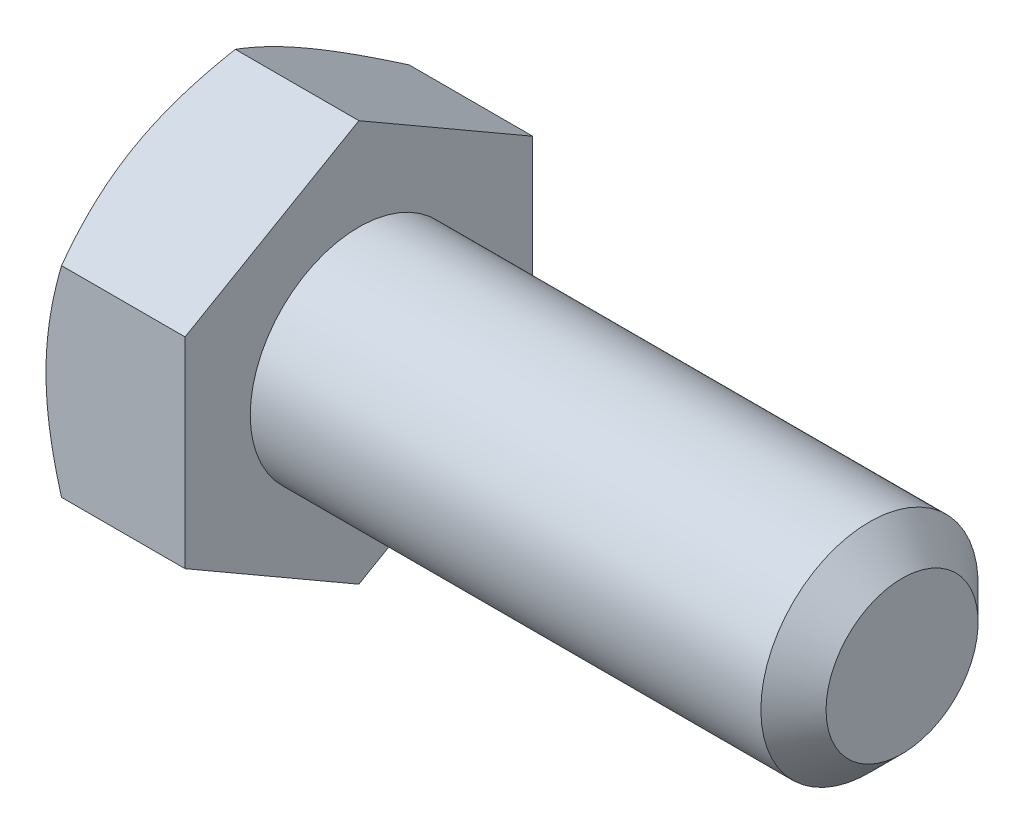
ISO-10303-21;
HEADER;
FILE_DESCRIPTION(('STEP AP214'),'2;1');
FILE_NAME('part.step','',(''),(''),'','','');
FILE_SCHEMA(('AUTOMOTIVE_DESIGN { 1 0 10303 214 1 1 1 1 }'));
ENDSEC;
DATA;
#1=APPLICATION_CONTEXT('core data for automotive mechanical design processes');
#2=APPLICATION_PROTOCOL_DEFINITION('international standard','automotive_design',2000,#1);
#3=PRODUCT_CONTEXT('',#1,'mechanical');
#4=PRODUCT('Part','Part','',(#3));
#5=PRODUCT_RELATED_PRODUCT_CATEGORY('part','',(#4));
#6=PRODUCT_DEFINITION_FORMATION('','',#4);
#7=PRODUCT_DEFINITION_CONTEXT('part definition',#1,'design');
#8=PRODUCT_DEFINITION('design','',#6,#7);
#9=PRODUCT_DEFINITION_SHAPE('','',#8);
#10=(LENGTH_UNIT() NAMED_UNIT(*) SI_UNIT(.MILLI.,.METRE.));
#11=(NAMED_UNIT(*) PLANE_ANGLE_UNIT() SI_UNIT($,.RADIAN.));
#12=(NAMED_UNIT(*) SI_UNIT($,.STERADIAN.) SOLID_ANGLE_UNIT());
#13=UNCERTAINTY_MEASURE_WITH_UNIT(LENGTH_MEASURE(1.E-05),#10,'distance_accuracy_value','');
#14=(GEOMETRIC_REPRESENTATION_CONTEXT(3) GLOBAL_UNCERTAINTY_ASSIGNED_CONTEXT((#13)) GLOBAL_UNIT_ASSIGNED_CONTEXT((#10,
#11,#12)) REPRESENTATION_CONTEXT('',''));
#15=CARTESIAN_POINT('',(0.,0.,0.));
#16=DIRECTION('',(0.,0.,1.));
#17=DIRECTION('',(1.,0.,0.));
#18=AXIS2_PLACEMENT_3D('',#15,#16,#17);
#19=CARTESIAN_POINT('',(25.,0.,0.));
#20=DIRECTION('',(-1.,0.,0.));
#21=DIRECTION('',(0.,0.,1.));
#22=AXIS2_PLACEMENT_3D('',#19,#20,#21);
#23=CYLINDRICAL_SURFACE('',#22,5.);
#24=CARTESIAN_POINT('',(23.5,0.,0.));
#25=DIRECTION('',(1.,0.,0.));
#26=DIRECTION('',(0.,0.,-1.));
#27=AXIS2_PLACEMENT_3D('',#24,#25,#26);
#28=CIRCLE('',#27,5.);
#29=CARTESIAN_POINT('',(23.5,0.,5.));
#30=VERTEX_POINT('',#29);
#31=EDGE_CURVE('E11',#30,#30,#28,.F.);
#32=ORIENTED_EDGE('',*,*,#31,.T.);
#33=EDGE_LOOP('',(#32));
#34=FACE_BOUND('',#33,.T.);
#35=CARTESIAN_POINT('',(0.,0.,0.));
#36=DIRECTION('',(-1.,0.,0.));
#37=DIRECTION('',(0.,0.,1.));
#38=AXIS2_PLACEMENT_3D('',#35,#36,#37);
#39=CIRCLE('',#38,5.);
#40=CARTESIAN_POINT('',(0.,0.,5.));
#41=VERTEX_POINT('',#40);
#42=EDGE_CURVE('E537',#41,#41,#39,.T.);
#43=ORIENTED_EDGE('',*,*,#42,.F.);
#44=EDGE_LOOP('',(#43));
#45=FACE_BOUND('',#44,.T.);
#46=ADVANCED_FACE('F362',(#34,#45),#23,.T.);
#47=CARTESIAN_POINT('',(25.,0.,0.));
#48=DIRECTION('',(1.,0.,0.));
#49=DIRECTION('',(0.,0.,-1.));
#50=AXIS2_PLACEMENT_3D('',#47,#48,#49);
#51=PLANE('',#50);
#52=CARTESIAN_POINT('',(25.,0.,0.));
#53=DIRECTION('',(1.,0.,0.));
#54=DIRECTION('',(0.,0.,-1.));
#55=AXIS2_PLACEMENT_3D('',#52,#53,#54);
#56=CIRCLE('',#55,3.49999999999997);
#57=CARTESIAN_POINT('',(25.,0.,3.49999999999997));
#58=VERTEX_POINT('',#57);
#59=EDGE_CURVE('E369',#58,#58,#56,.T.);
#60=ORIENTED_EDGE('',*,*,#59,.T.);
#61=EDGE_LOOP('',(#60));
#62=FACE_BOUND('',#61,.T.);
#63=ADVANCED_FACE('F522',(#62),#51,.T.);
#64=CARTESIAN_POINT('',(0.,-4.61880215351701,8.));
#65=DIRECTION('',(-1.,0.,0.));
#66=DIRECTION('',(0.,0.,1.));
#67=AXIS2_PLACEMENT_3D('',#64,#65,#66);
#68=PLANE('',#67);
#69=DIRECTION('',(0.,0.5,0.866025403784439));
#70=VECTOR('',#69,1.);
#71=CARTESIAN_POINT('',(0.,-9.23760430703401,0.));
#72=LINE('',#71,#70);
#73=CARTESIAN_POINT('',(0.,-9.23760430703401,0.));
#74=VERTEX_POINT('',#73);
#75=CARTESIAN_POINT('',(0.,-4.61880215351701,8.));
#76=VERTEX_POINT('',#75);
#77=EDGE_CURVE('E564',#74,#76,#72,.T.);
#78=ORIENTED_EDGE('',*,*,#77,.F.);
#79=DIRECTION('',(0.,0.5,-0.866025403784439));
#80=VECTOR('',#79,1.);
#81=CARTESIAN_POINT('',(0.,-9.23760430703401,0.));
#82=LINE('',#81,#80);
#83=CARTESIAN_POINT('',(0.,-4.61880215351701,-8.));
#84=VERTEX_POINT('',#83);
#85=EDGE_CURVE('E551',#74,#84,#82,.T.);
#86=ORIENTED_EDGE('',*,*,#85,.T.);
#87=DIRECTION('',(0.,1.,0.));
#88=VECTOR('',#87,1.);
#89=CARTESIAN_POINT('',(0.,-4.61880215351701,-8.));
#90=LINE('',#89,#88);
#91=CARTESIAN_POINT('',(0.,4.618802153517,-8.));
#92=VERTEX_POINT('',#91);
#93=EDGE_CURVE('E554',#84,#92,#90,.T.);
#94=ORIENTED_EDGE('',*,*,#93,.T.);
#95=DIRECTION('',(0.,0.5,0.866025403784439));
#96=VECTOR('',#95,1.);
#97=CARTESIAN_POINT('',(0.,4.618802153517,-8.));
#98=LINE('',#97,#96);
#99=CARTESIAN_POINT('',(0.,9.23760430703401,0.));
#100=VERTEX_POINT('',#99);
#101=EDGE_CURVE('E557',#92,#100,#98,.T.);
#102=ORIENTED_EDGE('',*,*,#101,.T.);
#103=DIRECTION('',(0.,0.5,-0.866025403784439));
#104=VECTOR('',#103,1.);
#105=CARTESIAN_POINT('',(0.,4.618802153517,8.));
#106=LINE('',#105,#104);
#107=CARTESIAN_POINT('',(0.,4.618802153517,8.));
#108=VERTEX_POINT('',#107);
#109=EDGE_CURVE('E560',#108,#100,#106,.T.);
#110=ORIENTED_EDGE('',*,*,#109,.F.);
#111=DIRECTION('',(0.,1.,0.));
#112=VECTOR('',#111,1.);
#113=CARTESIAN_POINT('',(0.,-4.61880215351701,8.));
#114=LINE('',#113,#112);
#115=EDGE_CURVE('E562',#76,#108,#114,.T.);
#116=ORIENTED_EDGE('',*,*,#115,.F.);
#117=EDGE_LOOP('',(#78,#86,#94,#102,#110,#116));
#118=FACE_BOUND('',#117,.T.);
#119=ORIENTED_EDGE('',*,*,#42,.T.);
#120=EDGE_LOOP('',(#119));
#121=FACE_BOUND('',#120,.T.);
#122=ADVANCED_FACE('F493',(#118,#121),#68,.F.);
#123=CARTESIAN_POINT('',(-6.4,-9.23760430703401,0.));
#124=DIRECTION('',(0.,0.866025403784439,-0.5));
#125=DIRECTION('',(0.,0.5,0.866025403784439));
#126=AXIS2_PLACEMENT_3D('',#123,#124,#125);
#127=PLANE('',#126);
#128=CARTESIAN_POINT('',(-5.68540215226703,-9.23771977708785,-0.00020000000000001));
#129=CARTESIAN_POINT('',(-5.7440092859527,-9.13619343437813,0.175648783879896));
#130=CARTESIAN_POINT('',(-5.79995659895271,-9.03428856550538,0.352153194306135));
#131=CARTESIAN_POINT('',(-5.90579899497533,-8.82965122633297,0.70659546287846));
#132=CARTESIAN_POINT('',(-5.95569146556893,-8.72691841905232,0.884533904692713));
#133=CARTESIAN_POINT('',(-6.09530720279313,-8.41707512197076,1.42119823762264));
#134=CARTESIAN_POINT('',(-6.17471882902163,-8.20874154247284,1.78204258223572));
#135=CARTESIAN_POINT('',(-6.26783835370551,-7.89697436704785,2.32203917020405));
#136=CARTESIAN_POINT('',(-6.29436541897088,-7.79447216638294,2.49957818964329));
#137=CARTESIAN_POINT('',(-6.33884682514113,-7.58900421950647,2.8554591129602));
#138=CARTESIAN_POINT('',(-6.35680192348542,-7.4860385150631,3.03380094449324));
#139=CARTESIAN_POINT('',(-6.38368435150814,-7.27992981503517,3.3907916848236));
#140=CARTESIAN_POINT('',(-6.39262192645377,-7.17678715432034,3.5694400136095));
#141=CARTESIAN_POINT('',(-6.40127769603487,-6.97040655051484,3.92690170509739));
#142=CARTESIAN_POINT('',(-6.40099617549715,-6.86716861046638,4.10571506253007));
#143=CARTESIAN_POINT('',(-6.39185497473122,-6.67416139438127,4.44001336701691));
#144=CARTESIAN_POINT('',(-6.38411039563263,-6.58437849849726,4.59552190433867));
#145=CARTESIAN_POINT('',(-6.36179886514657,-6.40502298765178,4.90617476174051));
#146=CARTESIAN_POINT('',(-6.34723145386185,-6.31545038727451,5.06131905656));
#147=CARTESIAN_POINT('',(-6.29363930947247,-6.04707935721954,5.52615131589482));
#148=CARTESIAN_POINT('',(-6.24473135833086,-5.86875596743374,5.83501648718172));
#149=CARTESIAN_POINT('',(-6.12246059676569,-5.51021755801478,6.4560232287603));
#150=CARTESIAN_POINT('',(-6.048579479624,-5.33004829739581,6.76808554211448));
#151=CARTESIAN_POINT('',(-5.88089985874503,-4.97239658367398,7.38755648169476));
#152=CARTESIAN_POINT('',(-5.78714073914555,-4.79490955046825,7.69497304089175));
#153=CARTESIAN_POINT('',(-5.68540215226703,-4.61868668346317,8.0002));
#154=B_SPLINE_CURVE_WITH_KNOTS('',3,(#128,#129,#130,#131,#132,#133,#134,#135,#136,#137,#138,
#139,#140,#141,#142,#143,#144,#145,#146,#147,#148,#149,#150,#151,#152,#153),.UNSPECIFIED.,.F.,
.F.,(4,2,2,2,2,2,2,2,2,2,2,2,4),(0.,0.63397354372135,1.26821965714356,2.53934712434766,
3.15934343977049,3.77928496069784,4.39852133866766,5.01773858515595,5.55680239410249,
6.09590254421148,7.17487077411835,8.27776850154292,9.37850115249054),.UNSPECIFIED.);
#155=CARTESIAN_POINT('',(-5.68546882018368,-9.23760430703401,0.));
#156=VERTEX_POINT('',#155);
#157=CARTESIAN_POINT('',(-6.4,-6.92820323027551,4.));
#158=VERTEX_POINT('',#157);
#159=EDGE_CURVE('E510',#156,#158,#154,.T.);
#160=ORIENTED_EDGE('',*,*,#159,.F.);
#161=DIRECTION('',(1.,0.,0.));
#162=VECTOR('',#161,1.);
#163=CARTESIAN_POINT('',(-6.4,-9.23760430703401,0.));
#164=LINE('',#163,#162);
#165=EDGE_CURVE('E549',#156,#74,#164,.T.);
#166=ORIENTED_EDGE('',*,*,#165,.T.);
#167=ORIENTED_EDGE('',*,*,#77,.T.);
#168=DIRECTION('',(1.,0.,0.));
#169=VECTOR('',#168,1.);
#170=CARTESIAN_POINT('',(-6.4,-4.61880215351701,8.));
#171=LINE('',#170,#169);
#172=CARTESIAN_POINT('',(-5.68546882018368,-4.61880215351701,8.));
#173=VERTEX_POINT('',#172);
#174=EDGE_CURVE('E540',#173,#76,#171,.T.);
#175=ORIENTED_EDGE('',*,*,#174,.F.);
#176=EDGE_CURVE('E464',#158,#173,#154,.T.);
#177=ORIENTED_EDGE('',*,*,#176,.F.);
#178=EDGE_LOOP('',(#160,#166,#167,#175,#177));
#179=FACE_BOUND('',#178,.T.);
#180=ADVANCED_FACE('F516',(#179),#127,.F.);
#181=CARTESIAN_POINT('',(-6.4,-4.61880215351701,8.));
#182=DIRECTION('',(0.,0.,-1.));
#183=DIRECTION('',(-1.,0.,0.));
#184=AXIS2_PLACEMENT_3D('',#181,#182,#183);
#185=PLANE('',#184);
#186=CARTESIAN_POINT('',(-2.40281206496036,-12.5978512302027,8.));
#187=CARTESIAN_POINT('',(-2.57388946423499,-12.246746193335,8.));
#188=CARTESIAN_POINT('',(-2.74338074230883,-11.8948553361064,8.));
#189=CARTESIAN_POINT('',(-3.07830251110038,-11.1890846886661,8.));
#190=CARTESIAN_POINT('',(-3.24373239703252,-10.8352046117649,8.));
#191=CARTESIAN_POINT('',(-3.57043443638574,-10.1233054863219,8.));
#192=CARTESIAN_POINT('',(-3.73168065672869,-9.76527449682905,8.));
#193=CARTESIAN_POINT('',(-4.04782365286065,-9.04643054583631,8.));
#194=CARTESIAN_POINT('',(-4.20272071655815,-8.68561771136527,8.));
#195=CARTESIAN_POINT('',(-4.50960168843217,-7.94836823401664,8.));
#196=CARTESIAN_POINT('',(-4.66130959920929,-7.57181608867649,8.));
#197=CARTESIAN_POINT('',(-4.95369969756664,-6.81437869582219,8.));
#198=CARTESIAN_POINT('',(-5.09438067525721,-6.4334929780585,8.));
#199=CARTESIAN_POINT('',(-5.36116349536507,-5.66743059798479,8.));
#200=CARTESIAN_POINT('',(-5.48729325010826,-5.28226375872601,8.));
#201=CARTESIAN_POINT('',(-5.72105487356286,-4.50642197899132,8.));
#202=CARTESIAN_POINT('',(-5.82869236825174,-4.11574875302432,8.));
#203=CARTESIAN_POINT('',(-6.01985550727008,-3.3307685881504,8.));
#204=CARTESIAN_POINT('',(-6.10351603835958,-2.93649538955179,8.));
#205=CARTESIAN_POINT('',(-6.20749259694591,-2.34134760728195,8.));
#206=CARTESIAN_POINT('',(-6.23856705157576,-2.14232908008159,8.));
#207=CARTESIAN_POINT('',(-6.29294025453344,-1.74323916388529,8.));
#208=CARTESIAN_POINT('',(-6.31623975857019,-1.54316787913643,8.));
#209=CARTESIAN_POINT('',(-6.35429623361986,-1.14493807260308,8.));
#210=CARTESIAN_POINT('',(-6.36916434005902,-0.946790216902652,8.));
#211=CARTESIAN_POINT('',(-6.39050002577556,-0.55004265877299,8.));
#212=CARTESIAN_POINT('',(-6.39696775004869,-0.351442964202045,8.));
#213=CARTESIAN_POINT('',(-6.40134753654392,0.0458536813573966,8.));
#214=CARTESIAN_POINT('',(-6.39925955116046,0.244550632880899,8.));
#215=CARTESIAN_POINT('',(-6.38658102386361,0.641675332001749,8.));
#216=CARTESIAN_POINT('',(-6.37599009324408,0.840103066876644,8.));
#217=CARTESIAN_POINT('',(-6.34097810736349,1.31123186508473,8.));
#218=CARTESIAN_POINT('',(-6.31284309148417,1.58366327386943,8.));
#219=CARTESIAN_POINT('',(-6.24203710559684,2.12661564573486,8.));
#220=CARTESIAN_POINT('',(-6.19936432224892,2.39713636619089,8.));
#221=CARTESIAN_POINT('',(-6.05179305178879,3.20545284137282,8.));
#222=CARTESIAN_POINT('',(-5.92736416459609,3.73973646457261,8.));
#223=CARTESIAN_POINT('',(-5.71012995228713,4.53906436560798,8.));
#224=CARTESIAN_POINT('',(-5.63154182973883,4.80821183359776,8.));
#225=CARTESIAN_POINT('',(-5.46584170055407,5.3438959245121,8.));
#226=CARTESIAN_POINT('',(-5.37872962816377,5.61043252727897,8.));
#227=CARTESIAN_POINT('',(-5.19740915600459,6.14097486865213,8.));
#228=CARTESIAN_POINT('',(-5.10320275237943,6.40498129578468,8.));
#229=CARTESIAN_POINT('',(-4.90883812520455,6.93077992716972,8.));
#230=CARTESIAN_POINT('',(-4.80868003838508,7.19257218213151,8.));
#231=CARTESIAN_POINT('',(-4.53123135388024,7.89757234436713,8.));
#232=CARTESIAN_POINT('',(-4.34922056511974,8.338920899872,8.));
#233=CARTESIAN_POINT('',(-3.97449001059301,9.21706508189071,8.));
#234=CARTESIAN_POINT('',(-3.78176905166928,9.65386019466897,8.));
#235=CARTESIAN_POINT('',(-3.38815487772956,10.5239434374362,8.));
#236=CARTESIAN_POINT('',(-3.18725853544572,10.9572301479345,8.));
#237=CARTESIAN_POINT('',(-2.77925077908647,11.8208356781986,8.));
#238=CARTESIAN_POINT('',(-2.57213961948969,12.2511546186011,8.));
#239=CARTESIAN_POINT('',(-2.15271844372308,13.1101061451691,8.));
#240=CARTESIAN_POINT('',(-1.94040058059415,13.5387348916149,8.));
#241=CARTESIAN_POINT('',(-1.51189757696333,14.3940561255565,8.));
#242=CARTESIAN_POINT('',(-1.29571240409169,14.8207485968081,8.));
#243=CARTESIAN_POINT('',(-0.860283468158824,15.6724483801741,8.));
#244=CARTESIAN_POINT('',(-0.641040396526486,16.0974560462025,8.));
#245=CARTESIAN_POINT('',(-0.20002108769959,16.9461557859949,8.));
#246=CARTESIAN_POINT('',(0.0217551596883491,17.3698478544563,8.));
#247=CARTESIAN_POINT('',(0.642968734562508,18.5495919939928,8.));
#248=CARTESIAN_POINT('',(1.04468640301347,19.3044430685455,8.));
#249=CARTESIAN_POINT('',(1.8529450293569,20.8116128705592,8.));
#250=CARTESIAN_POINT('',(2.25948628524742,21.5639314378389,8.));
#251=CARTESIAN_POINT('',(3.07479055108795,23.064082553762,8.));
#252=CARTESIAN_POINT('',(3.48354147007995,23.8119216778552,8.));
#253=CARTESIAN_POINT('',(4.09870759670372,24.9325210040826,8.));
#254=CARTESIAN_POINT('',(4.30409483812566,25.3058462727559,8.));
#255=CARTESIAN_POINT('',(4.71547851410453,26.0521604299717,8.));
#256=CARTESIAN_POINT('',(4.92147494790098,26.4251493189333,8.));
#257=CARTESIAN_POINT('',(5.12773824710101,26.7979906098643,8.));
#258=B_SPLINE_CURVE_WITH_KNOTS('',3,(#186,#187,#188,#189,#190,#191,#192,#193,#194,#195,#196,
#197,#198,#199,#200,#201,#202,#203,#204,#205,#206,#207,#208,#209,#210,#211,#212,#213,#214,#215,
#216,#217,#218,#219,#220,#221,#222,#223,#224,#225,#226,#227,#228,#229,#230,#231,#232,#233,#234,
#235,#236,#237,#238,#239,#240,#241,#242,#243,#244,#245,#246,#247,#248,#249,#250,#251,#252,#253,
#254,#255,#256,#257),.UNSPECIFIED.,.F.,.F.,(4,2,2,2,2,2,2,2,2,2,2,2,2,2,2,2,2,2,2,2,2,2,2,2,2,2,
2,2,2,2,2,2,2,2,2,4),(0.,1.17171303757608,2.34359951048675,3.52154779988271,4.69944261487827,
5.9172006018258,7.13509201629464,8.350606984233,9.56575149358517,10.7739194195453,
11.3780811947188,11.982184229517,12.5781274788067,13.174060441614,13.7699967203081,
14.3659602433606,15.1871414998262,16.0084252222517,17.651791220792,18.4928743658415,
19.3339639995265,20.1748178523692,21.0156523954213,22.4476587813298,23.87982501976,
25.312544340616,26.7452050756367,28.1801767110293,29.6151603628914,31.0498246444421,
32.48449470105,35.0497345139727,37.6151336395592,40.1718943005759,41.4501744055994,
42.7284529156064),.UNSPECIFIED.);
#259=CARTESIAN_POINT('',(-6.4,0.,8.));
#260=VERTEX_POINT('',#259);
#261=EDGE_CURVE('E566',#173,#260,#258,.T.);
#262=ORIENTED_EDGE('',*,*,#261,.F.);
#263=ORIENTED_EDGE('',*,*,#174,.T.);
#264=ORIENTED_EDGE('',*,*,#115,.T.);
#265=DIRECTION('',(1.,0.,0.));
#266=VECTOR('',#265,1.);
#267=CARTESIAN_POINT('',(-6.4,4.618802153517,8.));
#268=LINE('',#267,#266);
#269=CARTESIAN_POINT('',(-5.68546882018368,4.618802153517,8.));
#270=VERTEX_POINT('',#269);
#271=EDGE_CURVE('E542',#270,#108,#268,.T.);
#272=ORIENTED_EDGE('',*,*,#271,.F.);
#273=EDGE_CURVE('E435',#260,#270,#258,.T.);
#274=ORIENTED_EDGE('',*,*,#273,.F.);
#275=EDGE_LOOP('',(#262,#263,#264,#272,#274));
#276=FACE_BOUND('',#275,.T.);
#277=ADVANCED_FACE('F519',(#276),#185,.F.);
#278=CARTESIAN_POINT('',(-6.4,4.618802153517,8.));
#279=DIRECTION('',(0.,-0.866025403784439,-0.5));
#280=DIRECTION('',(0.,0.5,-0.866025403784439));
#281=AXIS2_PLACEMENT_3D('',#278,#279,#280);
#282=PLANE('',#281);
#283=CARTESIAN_POINT('',(-5.68540215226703,4.61868668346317,8.0002));
#284=CARTESIAN_POINT('',(-5.7440092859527,4.72021302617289,7.8243512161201));
#285=CARTESIAN_POINT('',(-5.79995659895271,4.82211789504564,7.64784680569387));
#286=CARTESIAN_POINT('',(-5.90579899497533,5.02675523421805,7.29340453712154));
#287=CARTESIAN_POINT('',(-5.95569146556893,5.12948804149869,7.11546609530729));
#288=CARTESIAN_POINT('',(-6.09530720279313,5.43933133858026,6.57880176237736));
#289=CARTESIAN_POINT('',(-6.17471882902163,5.64766491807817,6.21795741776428));
#290=CARTESIAN_POINT('',(-6.26783835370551,5.95943209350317,5.67796082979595));
#291=CARTESIAN_POINT('',(-6.29436541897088,6.06193429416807,5.50042181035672));
#292=CARTESIAN_POINT('',(-6.33884682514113,6.26740224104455,5.1445408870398));
#293=CARTESIAN_POINT('',(-6.35680192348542,6.37036794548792,4.96619905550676));
#294=CARTESIAN_POINT('',(-6.38368435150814,6.57647664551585,4.60920831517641));
#295=CARTESIAN_POINT('',(-6.39262192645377,6.67961930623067,4.4305599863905));
#296=CARTESIAN_POINT('',(-6.40127769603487,6.88599991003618,4.07309829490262));
#297=CARTESIAN_POINT('',(-6.40099617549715,6.98923785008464,3.89428493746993));
#298=CARTESIAN_POINT('',(-6.39185497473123,7.18224506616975,3.5599866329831));
#299=CARTESIAN_POINT('',(-6.38411039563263,7.27202796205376,3.40447809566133));
#300=CARTESIAN_POINT('',(-6.36179886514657,7.45138347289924,3.09382523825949));
#301=CARTESIAN_POINT('',(-6.34723145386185,7.5409560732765,2.93868094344));
#302=CARTESIAN_POINT('',(-6.29363930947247,7.80932710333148,2.47384868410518));
#303=CARTESIAN_POINT('',(-6.24473135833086,7.98765049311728,2.16498351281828));
#304=CARTESIAN_POINT('',(-6.12246059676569,8.34618890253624,1.5439767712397));
#305=CARTESIAN_POINT('',(-6.048579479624,8.52635816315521,1.23191445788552));
#306=CARTESIAN_POINT('',(-5.88089985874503,8.88400987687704,0.612443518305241));
#307=CARTESIAN_POINT('',(-5.78714073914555,9.06149691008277,0.305026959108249));
#308=CARTESIAN_POINT('',(-5.68540215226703,9.23771977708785,-0.000200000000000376));
#309=B_SPLINE_CURVE_WITH_KNOTS('',3,(#283,#284,#285,#286,#287,#288,#289,#290,#291,#292,#293,
#294,#295,#296,#297,#298,#299,#300,#301,#302,#303,#304,#305,#306,#307,#308),.UNSPECIFIED.,.F.,
.F.,(4,2,2,2,2,2,2,2,2,2,2,2,4),(0.,0.633973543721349,1.26821965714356,2.53934712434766,
3.15934343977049,3.77928496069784,4.39852133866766,5.01773858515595,5.55680239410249,
6.09590254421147,7.17487077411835,8.27776850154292,9.37850115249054),.UNSPECIFIED.);
#310=CARTESIAN_POINT('',(-6.4,6.92820323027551,4.));
#311=VERTEX_POINT('',#310);
#312=EDGE_CURVE('E431',#270,#311,#309,.T.);
#313=ORIENTED_EDGE('',*,*,#312,.F.);
#314=ORIENTED_EDGE('',*,*,#271,.T.);
#315=ORIENTED_EDGE('',*,*,#109,.T.);
#316=DIRECTION('',(1.,0.,0.));
#317=VECTOR('',#316,1.);
#318=CARTESIAN_POINT('',(-6.4,9.23760430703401,0.));
#319=LINE('',#318,#317);
#320=CARTESIAN_POINT('',(-5.68546882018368,9.23760430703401,0.));
#321=VERTEX_POINT('',#320);
#322=EDGE_CURVE('E463',#321,#100,#319,.T.);
#323=ORIENTED_EDGE('',*,*,#322,.F.);
#324=EDGE_CURVE('E439',#311,#321,#309,.T.);
#325=ORIENTED_EDGE('',*,*,#324,.F.);
#326=EDGE_LOOP('',(#313,#314,#315,#323,#325));
#327=FACE_BOUND('',#326,.T.);
#328=ADVANCED_FACE('F461',(#327),#282,.F.);
#329=CARTESIAN_POINT('',(-6.4,4.618802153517,-8.));
#330=DIRECTION('',(0.,0.866025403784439,-0.5));
#331=DIRECTION('',(0.,0.5,0.866025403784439));
#332=AXIS2_PLACEMENT_3D('',#329,#330,#331);
#333=PLANE('',#332);
#334=DIRECTION('',(1.,0.,0.));
#335=VECTOR('',#334,1.);
#336=CARTESIAN_POINT('',(-6.4,4.618802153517,-8.));
#337=LINE('',#336,#335);
#338=CARTESIAN_POINT('',(-5.68546882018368,4.618802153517,-8.));
#339=VERTEX_POINT('',#338);
#340=EDGE_CURVE('E545',#339,#92,#337,.T.);
#341=ORIENTED_EDGE('',*,*,#340,.F.);
#342=CARTESIAN_POINT('',(-5.68540215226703,4.61868668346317,-8.0002));
#343=CARTESIAN_POINT('',(-5.7440092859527,4.72021302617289,-7.8243512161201));
#344=CARTESIAN_POINT('',(-5.79995659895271,4.82211789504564,-7.64784680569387));
#345=CARTESIAN_POINT('',(-5.90579899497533,5.02675523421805,-7.29340453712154));
#346=CARTESIAN_POINT('',(-5.95569146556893,5.12948804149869,-7.11546609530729));
#347=CARTESIAN_POINT('',(-6.09530720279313,5.43933133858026,-6.57880176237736));
#348=CARTESIAN_POINT('',(-6.17471882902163,5.64766491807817,-6.21795741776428));
#349=CARTESIAN_POINT('',(-6.26783835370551,5.95943209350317,-5.67796082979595));
#350=CARTESIAN_POINT('',(-6.29436541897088,6.06193429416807,-5.50042181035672));
#351=CARTESIAN_POINT('',(-6.33884682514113,6.26740224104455,-5.1445408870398));
#352=CARTESIAN_POINT('',(-6.35680192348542,6.37036794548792,-4.96619905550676));
#353=CARTESIAN_POINT('',(-6.38368435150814,6.57647664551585,-4.60920831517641));
#354=CARTESIAN_POINT('',(-6.39262192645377,6.67961930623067,-4.4305599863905));
#355=CARTESIAN_POINT('',(-6.40127769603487,6.88599991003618,-4.07309829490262));
#356=CARTESIAN_POINT('',(-6.40099617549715,6.98923785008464,-3.89428493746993));
#357=CARTESIAN_POINT('',(-6.39185497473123,7.18224506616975,-3.5599866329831));
#358=CARTESIAN_POINT('',(-6.38411039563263,7.27202796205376,-3.40447809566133));
#359=CARTESIAN_POINT('',(-6.36179886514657,7.45138347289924,-3.09382523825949));
#360=CARTESIAN_POINT('',(-6.34723145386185,7.5409560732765,-2.93868094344));
#361=CARTESIAN_POINT('',(-6.29363930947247,7.80932710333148,-2.47384868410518));
#362=CARTESIAN_POINT('',(-6.24473135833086,7.98765049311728,-2.16498351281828));
#363=CARTESIAN_POINT('',(-6.12246059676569,8.34618890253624,-1.5439767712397));
#364=CARTESIAN_POINT('',(-6.048579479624,8.52635816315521,-1.23191445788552));
#365=CARTESIAN_POINT('',(-5.88089985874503,8.88400987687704,-0.612443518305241));
#366=CARTESIAN_POINT('',(-5.78714073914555,9.06149691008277,-0.305026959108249));
#367=CARTESIAN_POINT('',(-5.68540215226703,9.23771977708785,0.000200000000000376));
#368=B_SPLINE_CURVE_WITH_KNOTS('',3,(#342,#343,#344,#345,#346,#347,#348,#349,#350,#351,#352,
#353,#354,#355,#356,#357,#358,#359,#360,#361,#362,#363,#364,#365,#366,#367),.UNSPECIFIED.,.F.,
.F.,(4,2,2,2,2,2,2,2,2,2,2,2,4),(0.,0.633973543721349,1.26821965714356,2.53934712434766,
3.15934343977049,3.77928496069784,4.39852133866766,5.01773858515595,5.55680239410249,
6.09590254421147,7.17487077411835,8.27776850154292,9.37850115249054),.UNSPECIFIED.);
#369=CARTESIAN_POINT('',(-6.4,6.92820323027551,-4.));
#370=VERTEX_POINT('',#369);
#371=EDGE_CURVE('E466',#339,#370,#368,.T.);
#372=ORIENTED_EDGE('',*,*,#371,.T.);
#373=EDGE_CURVE('E446',#370,#321,#368,.T.);
#374=ORIENTED_EDGE('',*,*,#373,.T.);
#375=ORIENTED_EDGE('',*,*,#322,.T.);
#376=ORIENTED_EDGE('',*,*,#101,.F.);
#377=EDGE_LOOP('',(#341,#372,#374,#375,#376));
#378=FACE_BOUND('',#377,.T.);
#379=ADVANCED_FACE('F592',(#378),#333,.T.);
#380=CARTESIAN_POINT('',(-6.4,-4.61880215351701,-8.));
#381=DIRECTION('',(0.,0.,-1.));
#382=DIRECTION('',(-1.,0.,0.));
#383=AXIS2_PLACEMENT_3D('',#380,#381,#382);
#384=PLANE('',#383);
#385=DIRECTION('',(1.,0.,0.));
#386=VECTOR('',#385,1.);
#387=CARTESIAN_POINT('',(-6.4,-4.61880215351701,-8.));
#388=LINE('',#387,#386);
#389=CARTESIAN_POINT('',(-5.68546882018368,-4.61880215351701,-8.));
#390=VERTEX_POINT('',#389);
#391=EDGE_CURVE('E547',#390,#84,#388,.T.);
#392=ORIENTED_EDGE('',*,*,#391,.F.);
#393=CARTESIAN_POINT('',(-2.40281206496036,-12.5978512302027,-8.));
#394=CARTESIAN_POINT('',(-2.57388946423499,-12.246746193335,-8.));
#395=CARTESIAN_POINT('',(-2.74338074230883,-11.8948553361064,-8.));
#396=CARTESIAN_POINT('',(-3.07830251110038,-11.1890846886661,-8.));
#397=CARTESIAN_POINT('',(-3.24373239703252,-10.8352046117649,-8.));
#398=CARTESIAN_POINT('',(-3.57043443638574,-10.1233054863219,-8.));
#399=CARTESIAN_POINT('',(-3.73168065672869,-9.76527449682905,-8.));
#400=CARTESIAN_POINT('',(-4.04782365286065,-9.04643054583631,-8.));
#401=CARTESIAN_POINT('',(-4.20272071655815,-8.68561771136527,-8.));
#402=CARTESIAN_POINT('',(-4.50960168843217,-7.94836823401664,-8.));
#403=CARTESIAN_POINT('',(-4.66130959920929,-7.57181608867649,-8.));
#404=CARTESIAN_POINT('',(-4.95369969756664,-6.81437869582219,-8.));
#405=CARTESIAN_POINT('',(-5.09438067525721,-6.4334929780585,-8.));
#406=CARTESIAN_POINT('',(-5.36116349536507,-5.66743059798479,-8.));
#407=CARTESIAN_POINT('',(-5.48729325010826,-5.28226375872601,-8.));
#408=CARTESIAN_POINT('',(-5.72105487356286,-4.50642197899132,-8.));
#409=CARTESIAN_POINT('',(-5.82869236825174,-4.11574875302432,-8.));
#410=CARTESIAN_POINT('',(-6.01985550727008,-3.3307685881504,-8.));
#411=CARTESIAN_POINT('',(-6.10351603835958,-2.93649538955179,-8.));
#412=CARTESIAN_POINT('',(-6.20749259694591,-2.34134760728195,-8.));
#413=CARTESIAN_POINT('',(-6.23856705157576,-2.14232908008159,-8.));
#414=CARTESIAN_POINT('',(-6.29294025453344,-1.74323916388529,-8.));
#415=CARTESIAN_POINT('',(-6.31623975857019,-1.54316787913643,-8.));
#416=CARTESIAN_POINT('',(-6.35429623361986,-1.14493807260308,-8.));
#417=CARTESIAN_POINT('',(-6.36916434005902,-0.946790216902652,-8.));
#418=CARTESIAN_POINT('',(-6.39050002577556,-0.55004265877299,-8.));
#419=CARTESIAN_POINT('',(-6.39696775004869,-0.351442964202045,-8.));
#420=CARTESIAN_POINT('',(-6.40134753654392,0.0458536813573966,-8.));
#421=CARTESIAN_POINT('',(-6.39925955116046,0.244550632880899,-8.));
#422=CARTESIAN_POINT('',(-6.38658102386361,0.641675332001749,-8.));
#423=CARTESIAN_POINT('',(-6.37599009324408,0.840103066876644,-8.));
#424=CARTESIAN_POINT('',(-6.34097810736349,1.31123186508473,-8.));
#425=CARTESIAN_POINT('',(-6.31284309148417,1.58366327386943,-8.));
#426=CARTESIAN_POINT('',(-6.24203710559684,2.12661564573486,-8.));
#427=CARTESIAN_POINT('',(-6.19936432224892,2.39713636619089,-8.));
#428=CARTESIAN_POINT('',(-6.05179305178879,3.20545284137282,-8.));
#429=CARTESIAN_POINT('',(-5.92736416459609,3.73973646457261,-8.));
#430=CARTESIAN_POINT('',(-5.71012995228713,4.53906436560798,-8.));
#431=CARTESIAN_POINT('',(-5.63154182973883,4.80821183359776,-8.));
#432=CARTESIAN_POINT('',(-5.46584170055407,5.3438959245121,-8.));
#433=CARTESIAN_POINT('',(-5.37872962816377,5.61043252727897,-8.));
#434=CARTESIAN_POINT('',(-5.19740915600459,6.14097486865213,-8.));
#435=CARTESIAN_POINT('',(-5.10320275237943,6.40498129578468,-8.));
#436=CARTESIAN_POINT('',(-4.90883812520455,6.93077992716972,-8.));
#437=CARTESIAN_POINT('',(-4.80868003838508,7.19257218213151,-8.));
#438=CARTESIAN_POINT('',(-4.53123135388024,7.89757234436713,-8.));
#439=CARTESIAN_POINT('',(-4.34922056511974,8.338920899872,-8.));
#440=CARTESIAN_POINT('',(-3.97449001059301,9.21706508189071,-8.));
#441=CARTESIAN_POINT('',(-3.78176905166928,9.65386019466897,-8.));
#442=CARTESIAN_POINT('',(-3.38815487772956,10.5239434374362,-8.));
#443=CARTESIAN_POINT('',(-3.18725853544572,10.9572301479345,-8.));
#444=CARTESIAN_POINT('',(-2.77925077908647,11.8208356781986,-8.));
#445=CARTESIAN_POINT('',(-2.57213961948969,12.2511546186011,-8.));
#446=CARTESIAN_POINT('',(-2.15271844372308,13.1101061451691,-8.));
#447=CARTESIAN_POINT('',(-1.94040058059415,13.5387348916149,-8.));
#448=CARTESIAN_POINT('',(-1.51189757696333,14.3940561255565,-8.));
#449=CARTESIAN_POINT('',(-1.29571240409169,14.8207485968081,-8.));
#450=CARTESIAN_POINT('',(-0.860283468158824,15.6724483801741,-8.));
#451=CARTESIAN_POINT('',(-0.641040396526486,16.0974560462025,-8.));
#452=CARTESIAN_POINT('',(-0.20002108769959,16.9461557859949,-8.));
#453=CARTESIAN_POINT('',(0.0217551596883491,17.3698478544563,-8.));
#454=CARTESIAN_POINT('',(0.642968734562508,18.5495919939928,-8.));
#455=CARTESIAN_POINT('',(1.04468640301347,19.3044430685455,-8.));
#456=CARTESIAN_POINT('',(1.8529450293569,20.8116128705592,-8.));
#457=CARTESIAN_POINT('',(2.25948628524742,21.5639314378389,-8.));
#458=CARTESIAN_POINT('',(3.07479055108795,23.064082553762,-8.));
#459=CARTESIAN_POINT('',(3.48354147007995,23.8119216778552,-8.));
#460=CARTESIAN_POINT('',(4.09870759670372,24.9325210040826,-8.));
#461=CARTESIAN_POINT('',(4.30409483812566,25.3058462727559,-8.));
#462=CARTESIAN_POINT('',(4.71547851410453,26.0521604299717,-8.));
#463=CARTESIAN_POINT('',(4.92147494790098,26.4251493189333,-8.));
#464=CARTESIAN_POINT('',(5.12773824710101,26.7979906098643,-8.));
#465=B_SPLINE_CURVE_WITH_KNOTS('',3,(#393,#394,#395,#396,#397,#398,#399,#400,#401,#402,#403,
#404,#405,#406,#407,#408,#409,#410,#411,#412,#413,#414,#415,#416,#417,#418,#419,#420,#421,#422,
#423,#424,#425,#426,#427,#428,#429,#430,#431,#432,#433,#434,#435,#436,#437,#438,#439,#440,#441,
#442,#443,#444,#445,#446,#447,#448,#449,#450,#451,#452,#453,#454,#455,#456,#457,#458,#459,#460,
#461,#462,#463,#464),.UNSPECIFIED.,.F.,.F.,(4,2,2,2,2,2,2,2,2,2,2,2,2,2,2,2,2,2,2,2,2,2,2,2,2,2,
2,2,2,2,2,2,2,2,2,4),(0.,1.17171303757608,2.34359951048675,3.52154779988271,4.69944261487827,
5.9172006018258,7.13509201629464,8.350606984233,9.56575149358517,10.7739194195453,
11.3780811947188,11.982184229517,12.5781274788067,13.174060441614,13.7699967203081,
14.3659602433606,15.1871414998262,16.0084252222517,17.651791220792,18.4928743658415,
19.3339639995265,20.1748178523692,21.0156523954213,22.4476587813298,23.87982501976,
25.312544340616,26.7452050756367,28.1801767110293,29.6151603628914,31.0498246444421,
32.48449470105,35.0497345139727,37.6151336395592,40.1718943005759,41.4501744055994,
42.7284529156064),.UNSPECIFIED.);
#466=CARTESIAN_POINT('',(-6.4,0.,-8.));
#467=VERTEX_POINT('',#466);
#468=EDGE_CURVE('E384',#390,#467,#465,.T.);
#469=ORIENTED_EDGE('',*,*,#468,.T.);
#470=EDGE_CURVE('E515',#467,#339,#465,.T.);
#471=ORIENTED_EDGE('',*,*,#470,.T.);
#472=ORIENTED_EDGE('',*,*,#340,.T.);
#473=ORIENTED_EDGE('',*,*,#93,.F.);
#474=EDGE_LOOP('',(#392,#469,#471,#472,#473));
#475=FACE_BOUND('',#474,.T.);
#476=ADVANCED_FACE('F588',(#475),#384,.T.);
#477=CARTESIAN_POINT('',(-6.4,-9.23760430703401,0.));
#478=DIRECTION('',(0.,-0.866025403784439,-0.5));
#479=DIRECTION('',(0.,0.5,-0.866025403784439));
#480=AXIS2_PLACEMENT_3D('',#477,#478,#479);
#481=PLANE('',#480);
#482=ORIENTED_EDGE('',*,*,#165,.F.);
#483=CARTESIAN_POINT('',(-5.68540215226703,-9.23771977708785,0.00020000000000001));
#484=CARTESIAN_POINT('',(-5.7440092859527,-9.13619343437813,-0.175648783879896));
#485=CARTESIAN_POINT('',(-5.79995659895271,-9.03428856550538,-0.352153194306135));
#486=CARTESIAN_POINT('',(-5.90579899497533,-8.82965122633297,-0.70659546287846));
#487=CARTESIAN_POINT('',(-5.95569146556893,-8.72691841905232,-0.884533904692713));
#488=CARTESIAN_POINT('',(-6.09530720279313,-8.41707512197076,-1.42119823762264));
#489=CARTESIAN_POINT('',(-6.17471882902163,-8.20874154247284,-1.78204258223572));
#490=CARTESIAN_POINT('',(-6.26783835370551,-7.89697436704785,-2.32203917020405));
#491=CARTESIAN_POINT('',(-6.29436541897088,-7.79447216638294,-2.49957818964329));
#492=CARTESIAN_POINT('',(-6.33884682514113,-7.58900421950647,-2.8554591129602));
#493=CARTESIAN_POINT('',(-6.35680192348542,-7.4860385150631,-3.03380094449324));
#494=CARTESIAN_POINT('',(-6.38368435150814,-7.27992981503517,-3.3907916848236));
#495=CARTESIAN_POINT('',(-6.39262192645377,-7.17678715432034,-3.5694400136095));
#496=CARTESIAN_POINT('',(-6.40127769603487,-6.97040655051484,-3.92690170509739));
#497=CARTESIAN_POINT('',(-6.40099617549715,-6.86716861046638,-4.10571506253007));
#498=CARTESIAN_POINT('',(-6.39185497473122,-6.67416139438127,-4.44001336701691));
#499=CARTESIAN_POINT('',(-6.38411039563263,-6.58437849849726,-4.59552190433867));
#500=CARTESIAN_POINT('',(-6.36179886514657,-6.40502298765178,-4.90617476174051));
#501=CARTESIAN_POINT('',(-6.34723145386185,-6.31545038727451,-5.06131905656));
#502=CARTESIAN_POINT('',(-6.29363930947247,-6.04707935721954,-5.52615131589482));
#503=CARTESIAN_POINT('',(-6.24473135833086,-5.86875596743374,-5.83501648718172));
#504=CARTESIAN_POINT('',(-6.12246059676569,-5.51021755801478,-6.4560232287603));
#505=CARTESIAN_POINT('',(-6.048579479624,-5.33004829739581,-6.76808554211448));
#506=CARTESIAN_POINT('',(-5.88089985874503,-4.97239658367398,-7.38755648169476));
#507=CARTESIAN_POINT('',(-5.78714073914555,-4.79490955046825,-7.69497304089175));
#508=CARTESIAN_POINT('',(-5.68540215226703,-4.61868668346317,-8.0002));
#509=B_SPLINE_CURVE_WITH_KNOTS('',3,(#483,#484,#485,#486,#487,#488,#489,#490,#491,#492,#493,
#494,#495,#496,#497,#498,#499,#500,#501,#502,#503,#504,#505,#506,#507,#508),.UNSPECIFIED.,.F.,
.F.,(4,2,2,2,2,2,2,2,2,2,2,2,4),(0.,0.63397354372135,1.26821965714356,2.53934712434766,
3.15934343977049,3.77928496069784,4.39852133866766,5.01773858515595,5.55680239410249,
6.09590254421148,7.17487077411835,8.27776850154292,9.37850115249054),.UNSPECIFIED.);
#510=CARTESIAN_POINT('',(-6.4,-6.92820323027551,-4.));
#511=VERTEX_POINT('',#510);
#512=EDGE_CURVE('E580',#156,#511,#509,.T.);
#513=ORIENTED_EDGE('',*,*,#512,.T.);
#514=EDGE_CURVE('E458',#511,#390,#509,.T.);
#515=ORIENTED_EDGE('',*,*,#514,.T.);
#516=ORIENTED_EDGE('',*,*,#391,.T.);
#517=ORIENTED_EDGE('',*,*,#85,.F.);
#518=EDGE_LOOP('',(#482,#513,#515,#516,#517));
#519=FACE_BOUND('',#518,.T.);
#520=ADVANCED_FACE('F584',(#519),#481,.T.);
#521=CARTESIAN_POINT('',(-6.4,0.,0.));
#522=DIRECTION('',(1.,0.,0.));
#523=DIRECTION('',(0.,0.,1.));
#524=AXIS2_PLACEMENT_3D('',#521,#522,#523);
#525=CONICAL_SURFACE('',#524,8.,1.0471975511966);
#526=ORIENTED_EDGE('',*,*,#176,.T.);
#527=ORIENTED_EDGE('',*,*,#261,.T.);
#528=CARTESIAN_POINT('',(-6.4,0.,0.));
#529=DIRECTION('',(-1.,0.,0.));
#530=DIRECTION('',(0.,0.,1.));
#531=AXIS2_PLACEMENT_3D('',#528,#529,#530);
#532=CIRCLE('',#531,8.);
#533=EDGE_CURVE('E453',#158,#260,#532,.T.);
#534=ORIENTED_EDGE('',*,*,#533,.F.);
#535=EDGE_LOOP('',(#526,#527,#534));
#536=FACE_BOUND('',#535,.T.);
#537=ADVANCED_FACE('F491',(#536),#525,.T.);
#538=ORIENTED_EDGE('',*,*,#512,.F.);
#539=ORIENTED_EDGE('',*,*,#159,.T.);
#540=EDGE_CURVE('E536',#511,#158,#532,.T.);
#541=ORIENTED_EDGE('',*,*,#540,.F.);
#542=EDGE_LOOP('',(#538,#539,#541));
#543=FACE_BOUND('',#542,.T.);
#544=ADVANCED_FACE('F490',(#543),#525,.T.);
#545=ORIENTED_EDGE('',*,*,#468,.F.);
#546=ORIENTED_EDGE('',*,*,#514,.F.);
#547=EDGE_CURVE('E622',#467,#511,#532,.T.);
#548=ORIENTED_EDGE('',*,*,#547,.F.);
#549=EDGE_LOOP('',(#545,#546,#548));
#550=FACE_BOUND('',#549,.T.);
#551=ADVANCED_FACE('F484',(#550),#525,.T.);
#552=ORIENTED_EDGE('',*,*,#371,.F.);
#553=ORIENTED_EDGE('',*,*,#470,.F.);
#554=EDGE_CURVE('E451',#370,#467,#532,.T.);
#555=ORIENTED_EDGE('',*,*,#554,.F.);
#556=EDGE_LOOP('',(#552,#553,#555));
#557=FACE_BOUND('',#556,.T.);
#558=ADVANCED_FACE('F489',(#557),#525,.T.);
#559=EDGE_CURVE('E443',#311,#370,#532,.T.);
#560=ORIENTED_EDGE('',*,*,#559,.F.);
#561=ORIENTED_EDGE('',*,*,#324,.T.);
#562=ORIENTED_EDGE('',*,*,#373,.F.);
#563=EDGE_LOOP('',(#560,#561,#562));
#564=FACE_BOUND('',#563,.T.);
#565=ADVANCED_FACE('F444',(#564),#525,.T.);
#566=CARTESIAN_POINT('',(-6.4,0.,0.));
#567=DIRECTION('',(-1.,0.,0.));
#568=DIRECTION('',(0.,0.,1.));
#569=AXIS2_PLACEMENT_3D('',#566,#567,#568);
#570=CIRCLE('',#569,8.);
#571=EDGE_CURVE('E376',#260,#311,#570,.T.);
#572=ORIENTED_EDGE('',*,*,#571,.F.);
#573=ORIENTED_EDGE('',*,*,#273,.T.);
#574=ORIENTED_EDGE('',*,*,#312,.T.);
#575=EDGE_LOOP('',(#572,#573,#574));
#576=FACE_BOUND('',#575,.T.);
#577=ADVANCED_FACE('F433',(#576),#525,.T.);
#578=CARTESIAN_POINT('',(-6.4,-4.61880215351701,8.));
#579=DIRECTION('',(-1.,0.,0.));
#580=DIRECTION('',(0.,0.,1.));
#581=AXIS2_PLACEMENT_3D('',#578,#579,#580);
#582=PLANE('',#581);
#583=ORIENTED_EDGE('',*,*,#533,.T.);
#584=ORIENTED_EDGE('',*,*,#571,.T.);
#585=ORIENTED_EDGE('',*,*,#559,.T.);
#586=ORIENTED_EDGE('',*,*,#554,.T.);
#587=ORIENTED_EDGE('',*,*,#547,.T.);
#588=ORIENTED_EDGE('',*,*,#540,.T.);
#589=EDGE_LOOP('',(#583,#584,#585,#586,#587,#588));
#590=FACE_BOUND('',#589,.T.);
#591=ADVANCED_FACE('F455',(#590),#582,.T.);
#592=CARTESIAN_POINT('',(25.,0.,0.));
#593=DIRECTION('',(-1.,0.,0.));
#594=DIRECTION('',(0.,0.,1.));
#595=AXIS2_PLACEMENT_3D('',#592,#593,#594);
#596=CONICAL_SURFACE('',#595,3.49999999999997,0.785398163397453);
#597=CARTESIAN_POINT('',(23.5,0.,5.));
#598=CARTESIAN_POINT('',(23.515625,0.,4.984375));
#599=CARTESIAN_POINT('',(23.53125,0.,4.96875));
#600=CARTESIAN_POINT('',(23.5625,0.,4.9375));
#601=CARTESIAN_POINT('',(23.578125,0.,4.921875));
#602=CARTESIAN_POINT('',(23.609375,0.,4.890625));
#603=CARTESIAN_POINT('',(23.625,0.,4.875));
#604=CARTESIAN_POINT('',(23.65625,0.,4.84375));
#605=CARTESIAN_POINT('',(23.671875,0.,4.828125));
#606=CARTESIAN_POINT('',(23.703125,0.,4.796875));
#607=CARTESIAN_POINT('',(23.71875,0.,4.78125));
#608=CARTESIAN_POINT('',(23.75,0.,4.75));
#609=CARTESIAN_POINT('',(23.765625,0.,4.734375));
#610=CARTESIAN_POINT('',(23.796875,0.,4.703125));
#611=CARTESIAN_POINT('',(23.8125,0.,4.6875));
#612=CARTESIAN_POINT('',(23.84375,0.,4.65625));
#613=CARTESIAN_POINT('',(23.859375,0.,4.64062499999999));
#614=CARTESIAN_POINT('',(23.890625,0.,4.60937499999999));
#615=CARTESIAN_POINT('',(23.90625,0.,4.59374999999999));
#616=CARTESIAN_POINT('',(23.9375,0.,4.56249999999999));
#617=CARTESIAN_POINT('',(23.953125,0.,4.54687499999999));
#618=CARTESIAN_POINT('',(23.984375,0.,4.51562499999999));
#619=CARTESIAN_POINT('',(24.,0.,4.49999999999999));
#620=CARTESIAN_POINT('',(24.03125,0.,4.46874999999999));
#621=CARTESIAN_POINT('',(24.046875,0.,4.45312499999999));
#622=CARTESIAN_POINT('',(24.078125,0.,4.42187499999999));
#623=CARTESIAN_POINT('',(24.09375,0.,4.40624999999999));
#624=CARTESIAN_POINT('',(24.125,0.,4.37499999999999));
#625=CARTESIAN_POINT('',(24.140625,0.,4.35937499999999));
#626=CARTESIAN_POINT('',(24.171875,0.,4.32812499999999));
#627=CARTESIAN_POINT('',(24.1875,0.,4.31249999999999));
#628=CARTESIAN_POINT('',(24.21875,0.,4.28124999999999));
#629=CARTESIAN_POINT('',(24.234375,0.,4.26562499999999));
#630=CARTESIAN_POINT('',(24.265625,0.,4.23437499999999));
#631=CARTESIAN_POINT('',(24.28125,0.,4.21874999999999));
#632=CARTESIAN_POINT('',(24.3125,0.,4.18749999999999));
#633=CARTESIAN_POINT('',(24.328125,0.,4.17187499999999));
#634=CARTESIAN_POINT('',(24.359375,0.,4.14062499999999));
#635=CARTESIAN_POINT('',(24.375,0.,4.12499999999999));
#636=CARTESIAN_POINT('',(24.40625,0.,4.09374999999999));
#637=CARTESIAN_POINT('',(24.421875,0.,4.07812499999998));
#638=CARTESIAN_POINT('',(24.453125,0.,4.04687499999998));
#639=CARTESIAN_POINT('',(24.46875,0.,4.03124999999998));
#640=CARTESIAN_POINT('',(24.5,0.,3.99999999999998));
#641=CARTESIAN_POINT('',(24.515625,0.,3.98437499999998));
#642=CARTESIAN_POINT('',(24.546875,0.,3.95312499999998));
#643=CARTESIAN_POINT('',(24.5625,0.,3.93749999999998));
#644=CARTESIAN_POINT('',(24.59375,0.,3.90624999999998));
#645=CARTESIAN_POINT('',(24.609375,0.,3.89062499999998));
#646=CARTESIAN_POINT('',(24.640625,0.,3.85937499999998));
#647=CARTESIAN_POINT('',(24.65625,0.,3.84374999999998));
#648=CARTESIAN_POINT('',(24.6875,0.,3.81249999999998));
#649=CARTESIAN_POINT('',(24.703125,0.,3.79687499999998));
#650=CARTESIAN_POINT('',(24.734375,0.,3.76562499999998));
#651=CARTESIAN_POINT('',(24.75,0.,3.74999999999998));
#652=CARTESIAN_POINT('',(24.78125,0.,3.71874999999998));
#653=CARTESIAN_POINT('',(24.796875,0.,3.70312499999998));
#654=CARTESIAN_POINT('',(24.828125,0.,3.67187499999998));
#655=CARTESIAN_POINT('',(24.84375,0.,3.65624999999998));
#656=CARTESIAN_POINT('',(24.875,0.,3.62499999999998));
#657=CARTESIAN_POINT('',(24.890625,0.,3.60937499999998));
#658=CARTESIAN_POINT('',(24.921875,0.,3.57812499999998));
#659=CARTESIAN_POINT('',(24.9375,0.,3.56249999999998));
#660=CARTESIAN_POINT('',(24.96875,0.,3.53124999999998));
#661=CARTESIAN_POINT('',(24.984375,0.,3.51562499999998));
#662=CARTESIAN_POINT('',(25.,0.,3.49999999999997));
#663=B_SPLINE_CURVE_WITH_KNOTS('',3,(#597,#598,#599,#600,#601,#602,#603,#604,#605,#606,#607,
#608,#609,#610,#611,#612,#613,#614,#615,#616,#617,#618,#619,#620,#621,#622,#623,#624,#625,#626,
#627,#628,#629,#630,#631,#632,#633,#634,#635,#636,#637,#638,#639,#640,#641,#642,#643,#644,#645,
#646,#647,#648,#649,#650,#651,#652,#653,#654,#655,#656,#657,#658,#659,#660,#661,#662),
.UNSPECIFIED.,.F.,.F.,(4,2,2,2,2,2,2,2,2,2,2,2,2,2,2,2,2,2,2,2,2,2,2,2,2,2,2,2,2,2,2,2,4),(0.,
0.0662912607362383,0.132582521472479,0.198873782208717,0.265165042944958,0.331456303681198,
0.397747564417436,0.464038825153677,0.530330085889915,0.596621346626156,0.662912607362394,
0.729203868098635,0.795495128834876,0.861786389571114,0.928077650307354,0.994368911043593,
1.06066017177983,1.12695143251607,1.19324269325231,1.25953395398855,1.32582521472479,
1.39211647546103,1.45840773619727,1.52469899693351,1.59099025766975,1.65728151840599,
1.72357277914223,1.78986403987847,1.85615530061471,1.92244656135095,1.98873782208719,
2.05502908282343,2.12132034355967),.UNSPECIFIED.);
#664=EDGE_CURVE('BSEAM492',#30,#58,#663,.T.);
#665=ORIENTED_EDGE('',*,*,#31,.F.);
#666=ORIENTED_EDGE('',*,*,#59,.F.);
#667=ORIENTED_EDGE('',*,*,#664,.T.);
#668=ORIENTED_EDGE('',*,*,#664,.F.);
#669=EDGE_LOOP('',(#665,#667,#666,#668));
#670=FACE_BOUND('',#669,.T.);
#671=ADVANCED_FACE('F492',(#670),#596,.T.);
#672=CLOSED_SHELL('',(#46,#63,#122,#180,#277,#328,#379,#476,#520,#537,#544,#551,#558,#565,#577,
#591,#671));
#673=MANIFOLD_SOLID_BREP('B2',#672);
#674=ADVANCED_BREP_SHAPE_REPRESENTATION('',(#18,#673),#14);
#675=SHAPE_DEFINITION_REPRESENTATION(#9,#674);
ENDSEC;
END-ISO-10303-21;
